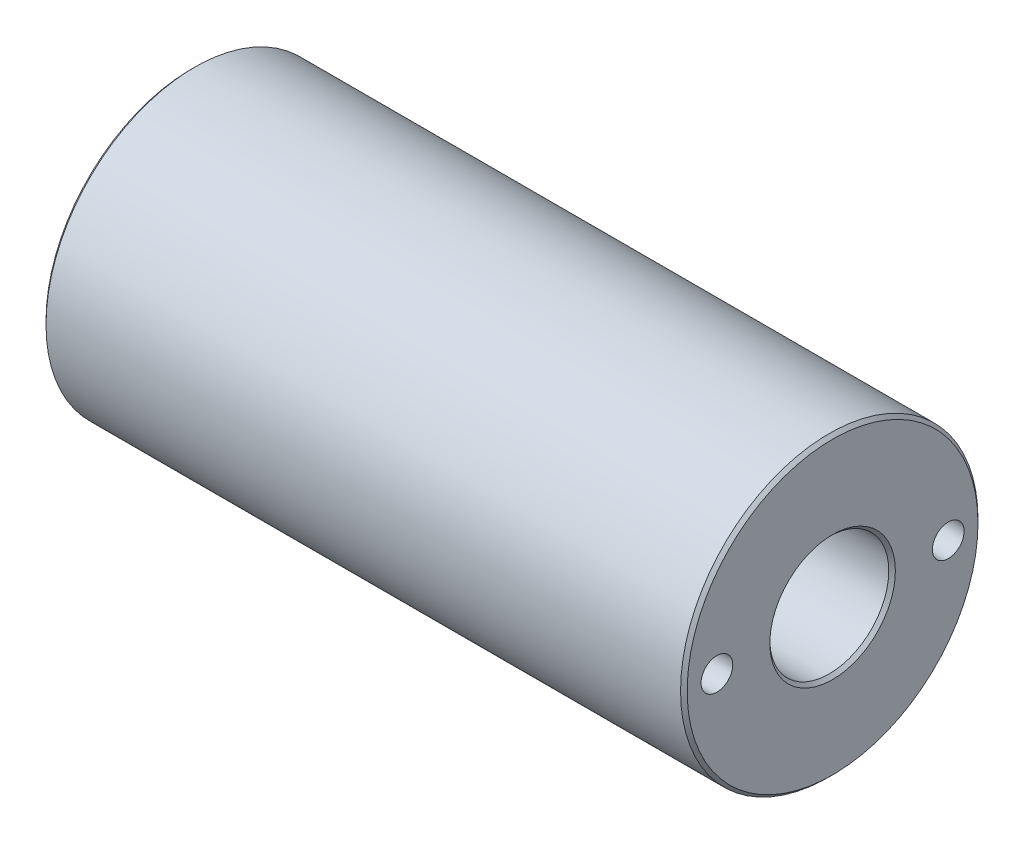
from build123d import *

# Parameters (mm, degrees)
ESQUISSE1_W               = 97
ESQUISSE1_H               = 15.5
CHANFREIN1_SIZE           = 0.5
TROU_TARAUD_M6X1_01_D     = 4.8
TROU_TARAUD_M6X1_01_DEPTH = 23
TROU_TARAUD_M6X1_01_TIP   = 1.442065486
ESQUISSE6_R               = 9
ENL_V_MAT_EXTRU_1_DEPTH   = 17
ENL_V_START               = -17
ESQUISSE7_R               = 9
ENL_V_MAT_EXTRU_2_DEPTH   = 17
CHANFREIN2_SIZE           = 0.5


with BuildPart() as part:
    # Esquisse1 → R_volution1 (revolve)
    with BuildSketch(Plane.XY, mode=Mode.PRIVATE) as r_volution1_sk:
        with Locations((-48.5, 14.75)):
            Rectangle(ESQUISSE1_W, ESQUISSE1_H)
    revolve(r_volution1_sk.sketch.rotate(Axis((446.537407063, 0, 0), (-1, 0, 0)), 90), axis=Axis((446.537407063, 0, 0), (-1, 0, 0)))

    # Chanfrein1
    chanfrein1_edges = [part.edges().sort_by_distance(p)[0] for p in [
        (-97, 0, 22.5),
        (0, 0, 22.5),
    ]]
    chamfer(chanfrein1_edges, length=CHANFREIN1_SIZE)

    # Trou taraud_ M6x1.01
    with Locations(Plane(origin=(0, 0, 0), x_dir=(0, 0, -1), z_dir=(1, 0, 0))):
        with Locations((-17.5, 0), (17.5, 0)):
            Hole(TROU_TARAUD_M6X1_01_D / 2, depth=TROU_TARAUD_M6X1_01_DEPTH)
            with Locations((0, 0, -(TROU_TARAUD_M6X1_01_DEPTH + TROU_TARAUD_M6X1_01_TIP / 2))):  # 118° drill point
                Cone(0, TROU_TARAUD_M6X1_01_D / 2, TROU_TARAUD_M6X1_01_TIP, mode=Mode.SUBTRACT)

    # Esquisse6 → Enl_v. mat.-Extru.1 (cut)
    with BuildSketch(Plane(origin=(0, 0, 0), x_dir=(0, 0, -1), z_dir=(1, 0, 0))):
        Circle(ESQUISSE6_R)
    extrude(amount=-ENL_V_MAT_EXTRU_1_DEPTH, mode=Mode.SUBTRACT)

    # Esquisse7 → Enl_v. mat.-Extru.2 (cut)
    with BuildSketch(Plane.ZY.offset(97).offset(ENL_V_START)):
        with Locations(Location((0, 0, 0), (0, 0, 180))):
            Circle(ESQUISSE7_R)
    extrude(amount=ENL_V_MAT_EXTRU_2_DEPTH, mode=Mode.SUBTRACT)

    # Chanfrein2
    chanfrein2_edges = [part.edges().sort_by_distance(p)[0] for p in [
        (-97, 0, 9),
        (0, 0, 9),
        (-80, 0, 7),
        (-17, 0, 7),
    ]]
    chamfer(chanfrein2_edges, length=CHANFREIN2_SIZE)


solid = part.part
